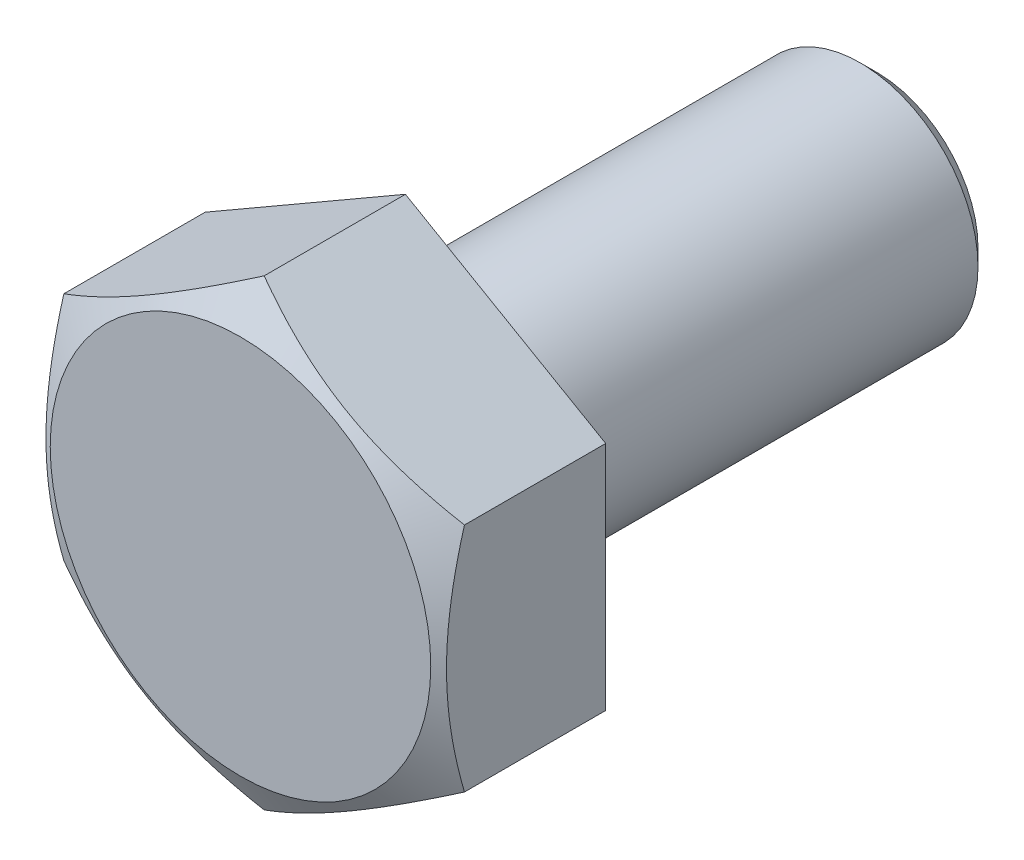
ISO-10303-21;
HEADER;
FILE_DESCRIPTION(('STEP AP214'),'2;1');
FILE_NAME('part.step','',(''),(''),'','','');
FILE_SCHEMA(('AUTOMOTIVE_DESIGN { 1 0 10303 214 1 1 1 1 }'));
ENDSEC;
DATA;
#1=APPLICATION_CONTEXT('core data for automotive mechanical design processes');
#2=APPLICATION_PROTOCOL_DEFINITION('international standard','automotive_design',2000,#1);
#3=PRODUCT_CONTEXT('',#1,'mechanical');
#4=PRODUCT('Part','Part','',(#3));
#5=PRODUCT_RELATED_PRODUCT_CATEGORY('part','',(#4));
#6=PRODUCT_DEFINITION_FORMATION('','',#4);
#7=PRODUCT_DEFINITION_CONTEXT('part definition',#1,'design');
#8=PRODUCT_DEFINITION('design','',#6,#7);
#9=PRODUCT_DEFINITION_SHAPE('','',#8);
#10=(LENGTH_UNIT() NAMED_UNIT(*) SI_UNIT(.MILLI.,.METRE.));
#11=(NAMED_UNIT(*) PLANE_ANGLE_UNIT() SI_UNIT($,.RADIAN.));
#12=(NAMED_UNIT(*) SI_UNIT($,.STERADIAN.) SOLID_ANGLE_UNIT());
#13=UNCERTAINTY_MEASURE_WITH_UNIT(LENGTH_MEASURE(1.E-05),#10,'distance_accuracy_value','');
#14=(GEOMETRIC_REPRESENTATION_CONTEXT(3) GLOBAL_UNCERTAINTY_ASSIGNED_CONTEXT((#13)) GLOBAL_UNIT_ASSIGNED_CONTEXT((#10,
#11,#12)) REPRESENTATION_CONTEXT('',''));
#15=CARTESIAN_POINT('',(0.,0.,0.));
#16=DIRECTION('',(0.,0.,1.));
#17=DIRECTION('',(1.,0.,0.));
#18=AXIS2_PLACEMENT_3D('',#15,#16,#17);
#19=CARTESIAN_POINT('',(8.50000000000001,-4.90747728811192,-0.001000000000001));
#20=DIRECTION('',(-0.499999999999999,0.866025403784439,0.));
#21=DIRECTION('',(-0.866025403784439,-0.499999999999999,0.));
#22=AXIS2_PLACEMENT_3D('',#19,#20,#21);
#23=PLANE('',#22);
#24=CARTESIAN_POINT('',(-0.000200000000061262,-9.81507004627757,5.99537008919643));
#25=CARTESIAN_POINT('',(0.18663922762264,-9.70719836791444,6.05763999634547));
#26=CARTESIAN_POINT('',(0.374175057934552,-9.59892450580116,6.11708383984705));
#27=CARTESIAN_POINT('',(0.750769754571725,-9.38149745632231,6.22954102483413));
#28=CARTESIAN_POINT('',(0.93982924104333,-9.27234391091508,6.28255159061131));
#29=CARTESIAN_POINT('',(1.51003475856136,-8.94313560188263,6.43089274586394));
#30=CARTESIAN_POINT('',(1.89343164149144,-8.72178130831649,6.51526720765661));
#31=CARTESIAN_POINT('',(2.46717766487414,-8.39052888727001,6.61420611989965));
#32=CARTESIAN_POINT('',(2.65581276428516,-8.28162036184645,6.64239093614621));
#33=CARTESIAN_POINT('',(3.03393602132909,-8.06331079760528,6.68965205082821));
#34=CARTESIAN_POINT('',(3.22342410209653,-7.95390980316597,6.70872915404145));
#35=CARTESIAN_POINT('',(3.60272652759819,-7.73491944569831,6.73729136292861));
#36=CARTESIAN_POINT('',(3.79254025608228,-7.62533043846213,6.74678735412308));
#37=CARTESIAN_POINT('',(4.17234305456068,-7.40605119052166,6.75598375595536));
#38=CARTESIAN_POINT('',(4.36233211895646,-7.29636095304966,6.75568446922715));
#39=CARTESIAN_POINT('',(4.71752301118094,-7.09129139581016,6.74597166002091));
#40=CARTESIAN_POINT('',(4.8827499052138,-6.99589760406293,6.73774296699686));
#41=CARTESIAN_POINT('',(5.21281671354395,-6.80533344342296,6.71403689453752));
#42=CARTESIAN_POINT('',(5.37765660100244,-6.71016309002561,6.69855902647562));
#43=CARTESIAN_POINT('',(5.87153810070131,-6.42502047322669,6.64161751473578));
#44=CARTESIAN_POINT('',(6.19970550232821,-6.23555293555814,6.58965307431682));
#45=CARTESIAN_POINT('',(6.85952142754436,-5.854608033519,6.45974119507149));
#46=CARTESIAN_POINT('',(7.19108574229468,-5.66317928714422,6.3812430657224));
#47=CARTESIAN_POINT('',(7.84926989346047,-5.28317649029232,6.20308479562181));
#48=CARTESIAN_POINT('',(8.17589815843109,-5.0945975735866,6.10346649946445));
#49=CARTESIAN_POINT('',(8.50020000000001,-4.90736181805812,5.99537008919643));
#50=B_SPLINE_CURVE_WITH_KNOTS('',3,(#24,#25,#26,#27,#28,#29,#30,#31,#32,#33,#34,#35,#36,#37,#38,
#39,#40,#41,#42,#43,#44,#45,#46,#47,#48,#49),.UNSPECIFIED.,.F.,.F.,(4,2,2,2,2,2,2,2,2,2,2,2,4),
(0.,0.673596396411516,1.34748239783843,2.69805431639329,3.35679995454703,4.01548737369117,
4.6734255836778,5.33134346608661,5.90409556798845,6.47688628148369,7.6232836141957,
8.79510569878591,9.96462743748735),.UNSPECIFIED.);
#51=CARTESIAN_POINT('',(0.,-9.81495457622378,5.99543675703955));
#52=VERTEX_POINT('',#51);
#53=CARTESIAN_POINT('',(8.50000000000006,-4.90747728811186,5.99543675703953));
#54=VERTEX_POINT('',#53);
#55=EDGE_CURVE('E49',#52,#54,#50,.T.);
#56=ORIENTED_EDGE('',*,*,#55,.F.);
#57=DIRECTION('',(0.,0.,1.));
#58=VECTOR('',#57,1.);
#59=CARTESIAN_POINT('',(0.,-9.81495457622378,-0.00100000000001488));
#60=LINE('',#59,#58);
#61=CARTESIAN_POINT('',(0.,-9.81495457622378,0.));
#62=VERTEX_POINT('',#61);
#63=EDGE_CURVE('E120',#62,#52,#60,.T.);
#64=ORIENTED_EDGE('',*,*,#63,.F.);
#65=DIRECTION('',(0.866025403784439,0.499999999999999,0.));
#66=VECTOR('',#65,1.);
#67=CARTESIAN_POINT('',(8.50000000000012,-4.90747728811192,0.));
#68=LINE('',#67,#66);
#69=CARTESIAN_POINT('',(8.50000000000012,-4.90747728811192,0.));
#70=VERTEX_POINT('',#69);
#71=EDGE_CURVE('E57',#62,#70,#68,.T.);
#72=ORIENTED_EDGE('',*,*,#71,.T.);
#73=DIRECTION('',(0.,0.,1.));
#74=VECTOR('',#73,1.);
#75=CARTESIAN_POINT('',(8.50000000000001,-4.90747728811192,-0.001000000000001));
#76=LINE('',#75,#74);
#77=EDGE_CURVE('E108',#70,#54,#76,.T.);
#78=ORIENTED_EDGE('',*,*,#77,.T.);
#79=EDGE_LOOP('',(#56,#64,#72,#78));
#80=FACE_BOUND('',#79,.T.);
#81=ADVANCED_FACE('F34',(#80),#23,.F.);
#82=CARTESIAN_POINT('',(-8.49999999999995,-4.90747728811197,-0.001000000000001));
#83=DIRECTION('',(-0.499999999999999,-0.866025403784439,0.));
#84=DIRECTION('',(0.866025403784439,-0.499999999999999,0.));
#85=AXIS2_PLACEMENT_3D('',#82,#83,#84);
#86=PLANE('',#85);
#87=ORIENTED_EDGE('',*,*,#63,.T.);
#88=CARTESIAN_POINT('',(0.00019999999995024,-9.81507004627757,5.99537008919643));
#89=CARTESIAN_POINT('',(-0.186639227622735,-9.70719836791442,6.05763999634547));
#90=CARTESIAN_POINT('',(-0.374175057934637,-9.59892450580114,6.11708383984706));
#91=CARTESIAN_POINT('',(-0.750769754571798,-9.38149745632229,6.22954102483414));
#92=CARTESIAN_POINT('',(-0.9398292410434,-9.27234391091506,6.28255159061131));
#93=CARTESIAN_POINT('',(-1.51003475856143,-8.94313560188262,6.43089274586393));
#94=CARTESIAN_POINT('',(-1.89343164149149,-8.72178130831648,6.5152672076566));
#95=CARTESIAN_POINT('',(-2.46717766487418,-8.39052888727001,6.61420611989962));
#96=CARTESIAN_POINT('',(-2.65581276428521,-8.28162036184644,6.64239093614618));
#97=CARTESIAN_POINT('',(-3.03393602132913,-8.06331079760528,6.68965205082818));
#98=CARTESIAN_POINT('',(-3.22342410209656,-7.95390980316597,6.70872915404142));
#99=CARTESIAN_POINT('',(-3.60272652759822,-7.73491944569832,6.73729136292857));
#100=CARTESIAN_POINT('',(-3.79254025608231,-7.62533043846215,6.74678735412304));
#101=CARTESIAN_POINT('',(-4.17234305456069,-7.40605119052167,6.75598375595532));
#102=CARTESIAN_POINT('',(-4.36233211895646,-7.29636095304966,6.75568446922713));
#103=CARTESIAN_POINT('',(-4.71752301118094,-7.09129139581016,6.74597166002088));
#104=CARTESIAN_POINT('',(-4.8827499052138,-6.99589760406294,6.73774296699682));
#105=CARTESIAN_POINT('',(-5.21281671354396,-6.80533344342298,6.71403689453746));
#106=CARTESIAN_POINT('',(-5.37765660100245,-6.71016309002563,6.69855902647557));
#107=CARTESIAN_POINT('',(-5.87153810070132,-6.4250204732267,6.64161751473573));
#108=CARTESIAN_POINT('',(-6.19970550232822,-6.23555293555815,6.58965307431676));
#109=CARTESIAN_POINT('',(-6.85952142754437,-5.85460803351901,6.45974119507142));
#110=CARTESIAN_POINT('',(-7.19108574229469,-5.66317928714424,6.38124306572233));
#111=CARTESIAN_POINT('',(-7.84926989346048,-5.28317649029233,6.20308479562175));
#112=CARTESIAN_POINT('',(-8.17589815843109,-5.09459757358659,6.10346649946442));
#113=CARTESIAN_POINT('',(-8.50020000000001,-4.90736181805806,5.99537008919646));
#114=B_SPLINE_CURVE_WITH_KNOTS('',3,(#88,#89,#90,#91,#92,#93,#94,#95,#96,#97,#98,#99,#100,#101,
#102,#103,#104,#105,#106,#107,#108,#109,#110,#111,#112,#113),.UNSPECIFIED.,.F.,.F.,(4,2,2,2,2,2,
2,2,2,2,2,2,4),(0.,0.6735963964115,1.3474823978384,2.69805431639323,3.35679995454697,
4.0154873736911,4.67342558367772,5.33134346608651,5.90409556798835,6.47688628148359,
7.6232836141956,8.79510569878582,9.96462743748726),.UNSPECIFIED.);
#115=CARTESIAN_POINT('',(-8.4999999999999,-4.90747728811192,5.99543675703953));
#116=VERTEX_POINT('',#115);
#117=EDGE_CURVE('E162',#52,#116,#114,.T.);
#118=ORIENTED_EDGE('',*,*,#117,.T.);
#119=DIRECTION('',(0.,0.,1.));
#120=VECTOR('',#119,1.);
#121=CARTESIAN_POINT('',(-8.49999999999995,-4.90747728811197,-0.001000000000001));
#122=LINE('',#121,#120);
#123=CARTESIAN_POINT('',(-8.50000000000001,-4.90747728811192,0.));
#124=VERTEX_POINT('',#123);
#125=EDGE_CURVE('E117',#124,#116,#122,.T.);
#126=ORIENTED_EDGE('',*,*,#125,.F.);
#127=DIRECTION('',(-0.866025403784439,0.499999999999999,0.));
#128=VECTOR('',#127,1.);
#129=CARTESIAN_POINT('',(-8.50000000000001,-4.90747728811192,0.));
#130=LINE('',#129,#128);
#131=EDGE_CURVE('E224',#62,#124,#130,.T.);
#132=ORIENTED_EDGE('',*,*,#131,.F.);
#133=EDGE_LOOP('',(#87,#118,#126,#132));
#134=FACE_BOUND('',#133,.T.);
#135=ADVANCED_FACE('F139',(#134),#86,.T.);
#136=CARTESIAN_POINT('',(-8.49999999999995,-4.90747728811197,-0.001000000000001));
#137=DIRECTION('',(0.999999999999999,0.,0.));
#138=DIRECTION('',(0.,0.,-1.));
#139=AXIS2_PLACEMENT_3D('',#136,#137,#138);
#140=PLANE('',#139);
#141=CARTESIAN_POINT('',(-8.49999999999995,-13.3300385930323,2.53449094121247));
#142=CARTESIAN_POINT('',(-8.49999999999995,-12.9574590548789,2.71581539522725));
#143=CARTESIAN_POINT('',(-8.49999999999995,-12.5840398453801,2.89544329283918));
#144=CARTESIAN_POINT('',(-8.49999999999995,-11.8350759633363,3.25035446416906));
#145=CARTESIAN_POINT('',(-8.49999999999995,-11.4595309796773,3.42563708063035));
#146=CARTESIAN_POINT('',(-8.49999999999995,-10.7040053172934,3.77175626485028));
#147=CARTESIAN_POINT('',(-8.49999999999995,-10.3240117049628,3.94256469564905));
#148=CARTESIAN_POINT('',(-8.49999999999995,-9.5610528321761,4.27738456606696));
#149=CARTESIAN_POINT('',(-8.49999999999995,-9.17808770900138,4.44139631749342));
#150=CARTESIAN_POINT('',(-8.49999999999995,-8.39578771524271,4.76614171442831));
#151=CARTESIAN_POINT('',(-8.49999999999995,-7.99633177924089,4.92658529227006));
#152=CARTESIAN_POINT('',(-8.49999999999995,-7.19280284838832,5.23568387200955));
#153=CARTESIAN_POINT('',(-8.49999999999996,-6.78872934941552,5.38433757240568));
#154=CARTESIAN_POINT('',(-8.49999999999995,-5.97602651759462,5.66606258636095));
#155=CARTESIAN_POINT('',(-8.49999999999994,-5.56740779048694,5.7991641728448));
#156=CARTESIAN_POINT('',(-8.49999999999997,-4.74432557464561,6.0456140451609));
#157=CARTESIAN_POINT('',(-8.50000000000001,-4.32986392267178,6.15896839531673));
#158=CARTESIAN_POINT('',(-8.50000000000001,-3.49705590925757,6.3599825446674));
#159=CARTESIAN_POINT('',(-8.49999999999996,-3.07874445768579,6.44778313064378));
#160=CARTESIAN_POINT('',(-8.49999999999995,-2.44735308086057,6.55657967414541));
#161=CARTESIAN_POINT('',(-8.49999999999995,-2.23622125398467,6.58902917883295));
#162=CARTESIAN_POINT('',(-8.49999999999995,-1.81285861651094,6.64566086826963));
#163=CARTESIAN_POINT('',(-8.49999999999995,-1.60062791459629,6.66984385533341));
#164=CARTESIAN_POINT('',(-8.49999999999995,-1.17819018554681,6.7091493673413));
#165=CARTESIAN_POINT('',(-8.49999999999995,-0.967994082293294,6.72438880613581));
#166=CARTESIAN_POINT('',(-8.49999999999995,-0.54714528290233,6.74595843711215));
#167=CARTESIAN_POINT('',(-8.49999999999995,-0.336492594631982,6.75228878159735));
#168=CARTESIAN_POINT('',(-8.49999999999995,0.0848938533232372,6.75588862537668));
#169=CARTESIAN_POINT('',(-8.49999999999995,0.295627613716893,6.75315804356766));
#170=CARTESIAN_POINT('',(-8.49999999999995,0.716788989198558,6.73870443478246));
#171=CARTESIAN_POINT('',(-8.49999999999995,0.927216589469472,6.7269809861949));
#172=CARTESIAN_POINT('',(-8.49999999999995,1.42840873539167,6.68860038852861));
#173=CARTESIAN_POINT('',(-8.49999999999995,1.71887274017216,6.65792861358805));
#174=CARTESIAN_POINT('',(-8.49999999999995,2.29772833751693,6.58108968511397));
#175=CARTESIAN_POINT('',(-8.49999999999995,2.58611966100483,6.53492055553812));
#176=CARTESIAN_POINT('',(-8.49999999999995,3.44779761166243,6.37560864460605));
#177=CARTESIAN_POINT('',(-8.49999999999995,4.01729795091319,6.24168658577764));
#178=CARTESIAN_POINT('',(-8.49999999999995,4.86928176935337,6.00833364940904));
#179=CARTESIAN_POINT('',(-8.49999999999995,5.15615049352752,5.92398381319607));
#180=CARTESIAN_POINT('',(-8.49999999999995,5.72710339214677,5.74625067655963));
#181=CARTESIAN_POINT('',(-8.49999999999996,6.01118754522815,5.65286730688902));
#182=CARTESIAN_POINT('',(-8.49999999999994,6.57665930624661,5.45858816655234));
#183=CARTESIAN_POINT('',(-8.49999999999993,6.85804767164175,5.35769458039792));
#184=CARTESIAN_POINT('',(-8.49999999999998,7.41847111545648,5.14960951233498));
#185=CARTESIAN_POINT('',(-8.50000000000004,7.69750624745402,5.04241817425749));
#186=CARTESIAN_POINT('',(-8.5000000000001,8.44980890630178,4.74523309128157));
#187=CARTESIAN_POINT('',(-8.49999999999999,8.92109165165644,4.55021974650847));
#188=CARTESIAN_POINT('',(-8.49999999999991,9.85881492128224,4.14883877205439));
#189=CARTESIAN_POINT('',(-8.49999999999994,10.3252549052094,3.94246989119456));
#190=CARTESIAN_POINT('',(-8.49999999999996,11.2544088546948,3.52107400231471));
#191=CARTESIAN_POINT('',(-8.49999999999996,11.7171213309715,3.30604372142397));
#192=CARTESIAN_POINT('',(-8.49999999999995,12.639397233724,2.86940227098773));
#193=CARTESIAN_POINT('',(-8.49999999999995,13.098960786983,2.64779136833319));
#194=CARTESIAN_POINT('',(-8.49999999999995,14.0162966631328,2.19906730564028));
#195=CARTESIAN_POINT('',(-8.49999999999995,14.4740649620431,1.97194593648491));
#196=CARTESIAN_POINT('',(-8.49999999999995,15.3875498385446,1.51361143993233));
#197=CARTESIAN_POINT('',(-8.49999999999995,15.84326639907,1.28239827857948));
#198=CARTESIAN_POINT('',(-8.49999999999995,16.7529150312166,0.816736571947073));
#199=CARTESIAN_POINT('',(-8.49999999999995,17.2068474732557,0.582288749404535));
#200=CARTESIAN_POINT('',(-8.49999999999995,18.1133194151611,0.110714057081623));
#201=CARTESIAN_POINT('',(-8.49999999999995,18.5658589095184,-0.12641282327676));
#202=CARTESIAN_POINT('',(-8.49999999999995,19.8259423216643,-0.790591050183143));
#203=CARTESIAN_POINT('',(-8.49999999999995,20.6322150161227,-1.22005367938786));
#204=CARTESIAN_POINT('',(-8.49999999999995,22.2420810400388,-2.08407815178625));
#205=CARTESIAN_POINT('',(-8.49999999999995,23.0456742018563,-2.51864030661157));
#206=CARTESIAN_POINT('',(-8.49999999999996,24.6481263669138,-3.39011718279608));
#207=CARTESIAN_POINT('',(-8.49999999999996,25.4469922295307,-3.82701929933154));
#208=CARTESIAN_POINT('',(-8.49999999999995,26.6440649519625,-4.4845286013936));
#209=CARTESIAN_POINT('',(-8.49999999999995,27.042869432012,-4.70404918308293));
#210=CARTESIAN_POINT('',(-8.49999999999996,27.8401226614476,-5.143734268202));
#211=CARTESIAN_POINT('',(-8.49999999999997,28.238571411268,-5.36389877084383));
#212=CARTESIAN_POINT('',(-8.50000000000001,28.6368640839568,-5.58434533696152));
#213=B_SPLINE_CURVE_WITH_KNOTS('',3,(#141,#142,#143,#144,#145,#146,#147,#148,#149,#150,#151,
#152,#153,#154,#155,#156,#157,#158,#159,#160,#161,#162,#163,#164,#165,#166,#167,#168,#169,#170,
#171,#172,#173,#174,#175,#176,#177,#178,#179,#180,#181,#182,#183,#184,#185,#186,#187,#188,#189,
#190,#191,#192,#193,#194,#195,#196,#197,#198,#199,#200,#201,#202,#203,#204,#205,#206,#207,#208,
#209,#210,#211,#212),.UNSPECIFIED.,.F.,.F.,(4,2,2,2,2,2,2,2,2,2,2,2,2,2,2,2,2,2,2,2,2,2,2,2,2,2,
2,2,2,2,2,2,2,2,2,4),(0.,1.2430939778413,2.48637484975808,3.73617582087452,4.98591939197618,
6.27719450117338,7.56861195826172,8.85747218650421,10.1459359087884,11.4271603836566,
12.0678568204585,12.7084910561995,13.3405525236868,13.9726031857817,14.6046595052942,
15.2367454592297,16.1124907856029,16.9883478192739,18.7409320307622,19.6378908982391,
20.5348566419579,21.4315624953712,22.3282478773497,23.8581353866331,25.3881918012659,
26.9188319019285,28.4494100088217,29.9824283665,31.5154594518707,33.0481533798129,
34.5808533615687,37.3213766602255,40.0620683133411,42.7936585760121,44.1593479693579,
45.5250356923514),.UNSPECIFIED.);
#214=CARTESIAN_POINT('',(-8.49999999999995,4.90747728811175,5.99543675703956));
#215=VERTEX_POINT('',#214);
#216=EDGE_CURVE('E197',#215,#116,#213,.F.);
#217=ORIENTED_EDGE('',*,*,#216,.F.);
#218=DIRECTION('',(0.,0.,1.));
#219=VECTOR('',#218,1.);
#220=CARTESIAN_POINT('',(-8.50000000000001,4.90747728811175,-0.00100000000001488));
#221=LINE('',#220,#219);
#222=CARTESIAN_POINT('',(-8.50000000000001,4.90747728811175,0.));
#223=VERTEX_POINT('',#222);
#224=EDGE_CURVE('E110',#223,#215,#221,.T.);
#225=ORIENTED_EDGE('',*,*,#224,.F.);
#226=DIRECTION('',(0.,-1.,0.));
#227=VECTOR('',#226,1.);
#228=CARTESIAN_POINT('',(-8.50000000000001,-4.90747728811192,0.));
#229=LINE('',#228,#227);
#230=EDGE_CURVE('E225',#223,#124,#229,.T.);
#231=ORIENTED_EDGE('',*,*,#230,.T.);
#232=ORIENTED_EDGE('',*,*,#125,.T.);
#233=EDGE_LOOP('',(#217,#225,#231,#232));
#234=FACE_BOUND('',#233,.T.);
#235=ADVANCED_FACE('F145',(#234),#140,.F.);
#236=CARTESIAN_POINT('',(-8.50000000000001,4.90747728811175,-0.00100000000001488));
#237=DIRECTION('',(0.499999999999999,-0.866025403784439,0.));
#238=DIRECTION('',(0.866025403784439,0.499999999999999,0.));
#239=AXIS2_PLACEMENT_3D('',#236,#237,#238);
#240=PLANE('',#239);
#241=CARTESIAN_POINT('',(0.000200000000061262,9.81507004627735,5.99537008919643));
#242=CARTESIAN_POINT('',(-0.186639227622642,9.70719836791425,6.05763999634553));
#243=CARTESIAN_POINT('',(-0.374175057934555,9.59892450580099,6.11708383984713));
#244=CARTESIAN_POINT('',(-0.75076975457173,9.38149745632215,6.22954102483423));
#245=CARTESIAN_POINT('',(-0.939829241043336,9.27234391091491,6.2825515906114));
#246=CARTESIAN_POINT('',(-1.51003475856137,8.94313560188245,6.43089274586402));
#247=CARTESIAN_POINT('',(-1.89343164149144,8.72178130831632,6.51526720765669));
#248=CARTESIAN_POINT('',(-2.46717766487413,8.39052888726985,6.61420611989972));
#249=CARTESIAN_POINT('',(-2.65581276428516,8.28162036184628,6.64239093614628));
#250=CARTESIAN_POINT('',(-3.03393602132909,8.06331079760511,6.68965205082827));
#251=CARTESIAN_POINT('',(-3.22342410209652,7.95390980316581,6.70872915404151));
#252=CARTESIAN_POINT('',(-3.60272652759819,7.73491944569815,6.73729136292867));
#253=CARTESIAN_POINT('',(-3.79254025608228,7.62533043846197,6.74678735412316));
#254=CARTESIAN_POINT('',(-4.17234305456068,7.40605119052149,6.75598375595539));
#255=CARTESIAN_POINT('',(-4.36233211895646,7.29636095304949,6.75568446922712));
#256=CARTESIAN_POINT('',(-4.71752301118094,7.09129139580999,6.74597166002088));
#257=CARTESIAN_POINT('',(-4.88274990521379,6.99589760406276,6.73774296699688));
#258=CARTESIAN_POINT('',(-5.21281671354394,6.80533344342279,6.71403689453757));
#259=CARTESIAN_POINT('',(-5.37765660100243,6.71016309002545,6.69855902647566));
#260=CARTESIAN_POINT('',(-5.87153810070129,6.42502047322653,6.6416175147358));
#261=CARTESIAN_POINT('',(-6.19970550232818,6.23555293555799,6.58965307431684));
#262=CARTESIAN_POINT('',(-6.85952142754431,5.85460803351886,6.45974119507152));
#263=CARTESIAN_POINT('',(-7.19108574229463,5.66317928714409,6.38124306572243));
#264=CARTESIAN_POINT('',(-7.84926989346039,5.28317649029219,6.20308479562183));
#265=CARTESIAN_POINT('',(-8.175898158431,5.09459757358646,6.10346649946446));
#266=CARTESIAN_POINT('',(-8.5001999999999,4.90736181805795,5.99537008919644));
#267=B_SPLINE_CURVE_WITH_KNOTS('',3,(#241,#242,#243,#244,#245,#246,#247,#248,#249,#250,#251,
#252,#253,#254,#255,#256,#257,#258,#259,#260,#261,#262,#263,#264,#265,#266),.UNSPECIFIED.,.F.,
.F.,(4,2,2,2,2,2,2,2,2,2,2,2,4),(0.,0.673596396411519,1.34748239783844,2.69805431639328,
3.35679995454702,4.01548737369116,4.67342558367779,5.3313434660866,5.90409556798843,
6.47688628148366,7.62328361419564,8.79510569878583,9.96462743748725),.UNSPECIFIED.);
#268=CARTESIAN_POINT('',(0.,9.81495457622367,5.99543675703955));
#269=VERTEX_POINT('',#268);
#270=EDGE_CURVE('E103',#269,#215,#267,.T.);
#271=ORIENTED_EDGE('',*,*,#270,.F.);
#272=DIRECTION('',(0.,0.,1.));
#273=VECTOR('',#272,1.);
#274=CARTESIAN_POINT('',(0.,9.81495457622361,-0.000999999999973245));
#275=LINE('',#274,#273);
#276=CARTESIAN_POINT('',(0.,9.81495457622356,0.));
#277=VERTEX_POINT('',#276);
#278=EDGE_CURVE('E102',#277,#269,#275,.T.);
#279=ORIENTED_EDGE('',*,*,#278,.F.);
#280=DIRECTION('',(-0.866025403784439,-0.499999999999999,0.));
#281=VECTOR('',#280,1.);
#282=CARTESIAN_POINT('',(-8.50000000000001,4.90747728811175,0.));
#283=LINE('',#282,#281);
#284=EDGE_CURVE('E229',#277,#223,#283,.T.);
#285=ORIENTED_EDGE('',*,*,#284,.T.);
#286=ORIENTED_EDGE('',*,*,#224,.T.);
#287=EDGE_LOOP('',(#271,#279,#285,#286));
#288=FACE_BOUND('',#287,.T.);
#289=ADVANCED_FACE('F204',(#288),#240,.F.);
#290=CARTESIAN_POINT('',(8.50000000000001,4.90747728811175,-0.00100000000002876));
#291=DIRECTION('',(0.499999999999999,0.866025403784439,0.));
#292=DIRECTION('',(-0.866025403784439,0.499999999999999,0.));
#293=AXIS2_PLACEMENT_3D('',#290,#291,#292);
#294=PLANE('',#293);
#295=ORIENTED_EDGE('',*,*,#278,.T.);
#296=CARTESIAN_POINT('',(-0.000200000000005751,9.81507004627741,5.99537008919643));
#297=CARTESIAN_POINT('',(0.186639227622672,9.70719836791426,6.05763999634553));
#298=CARTESIAN_POINT('',(0.374175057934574,9.59892450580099,6.11708383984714));
#299=CARTESIAN_POINT('',(0.750769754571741,9.38149745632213,6.22954102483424));
#300=CARTESIAN_POINT('',(0.93982924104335,9.2723439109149,6.28255159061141));
#301=CARTESIAN_POINT('',(1.51003475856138,8.94313560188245,6.43089274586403));
#302=CARTESIAN_POINT('',(1.89343164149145,8.72178130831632,6.51526720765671));
#303=CARTESIAN_POINT('',(2.46717766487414,8.39052888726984,6.61420611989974));
#304=CARTESIAN_POINT('',(2.65581276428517,8.28162036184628,6.6423909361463));
#305=CARTESIAN_POINT('',(3.03393602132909,8.06331079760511,6.68965205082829));
#306=CARTESIAN_POINT('',(3.22342410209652,7.95390980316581,6.70872915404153));
#307=CARTESIAN_POINT('',(3.60272652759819,7.73491944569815,6.7372913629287));
#308=CARTESIAN_POINT('',(3.79254025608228,7.62533043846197,6.74678735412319));
#309=CARTESIAN_POINT('',(4.17234305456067,7.40605119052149,6.75598375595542));
#310=CARTESIAN_POINT('',(4.36233211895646,7.29636095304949,6.75568446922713));
#311=CARTESIAN_POINT('',(4.71752301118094,7.09129139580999,6.7459716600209));
#312=CARTESIAN_POINT('',(4.8827499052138,6.99589760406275,6.73774296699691));
#313=CARTESIAN_POINT('',(5.21281671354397,6.80533344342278,6.71403689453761));
#314=CARTESIAN_POINT('',(5.37765660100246,6.71016309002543,6.6985590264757));
#315=CARTESIAN_POINT('',(5.87153810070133,6.42502047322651,6.64161751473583));
#316=CARTESIAN_POINT('',(6.19970550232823,6.23555293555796,6.58965307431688));
#317=CARTESIAN_POINT('',(6.85952142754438,5.85460803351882,6.45974119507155));
#318=CARTESIAN_POINT('',(7.1910857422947,5.66317928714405,6.38124306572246));
#319=CARTESIAN_POINT('',(7.84926989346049,5.28317649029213,6.20308479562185));
#320=CARTESIAN_POINT('',(8.1758981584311,5.09459757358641,6.10346649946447));
#321=CARTESIAN_POINT('',(8.50020000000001,4.9073618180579,5.99537008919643));
#322=B_SPLINE_CURVE_WITH_KNOTS('',3,(#296,#297,#298,#299,#300,#301,#302,#303,#304,#305,#306,
#307,#308,#309,#310,#311,#312,#313,#314,#315,#316,#317,#318,#319,#320,#321),.UNSPECIFIED.,.F.,
.F.,(4,2,2,2,2,2,2,2,2,2,2,2,4),(0.,0.673596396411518,1.34748239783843,2.69805431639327,
3.35679995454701,4.01548737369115,4.67342558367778,5.33134346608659,5.90409556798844,
6.47688628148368,7.6232836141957,8.79510569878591,9.96462743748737),.UNSPECIFIED.);
#323=CARTESIAN_POINT('',(8.50000000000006,4.90747728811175,5.99543675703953));
#324=VERTEX_POINT('',#323);
#325=EDGE_CURVE('E87',#269,#324,#322,.T.);
#326=ORIENTED_EDGE('',*,*,#325,.T.);
#327=DIRECTION('',(0.,0.,1.));
#328=VECTOR('',#327,1.);
#329=CARTESIAN_POINT('',(8.50000000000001,4.90747728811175,-0.00100000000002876));
#330=LINE('',#329,#328);
#331=CARTESIAN_POINT('',(8.50000000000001,4.90747728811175,0.));
#332=VERTEX_POINT('',#331);
#333=EDGE_CURVE('E100',#332,#324,#330,.T.);
#334=ORIENTED_EDGE('',*,*,#333,.F.);
#335=DIRECTION('',(0.866025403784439,-0.499999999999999,0.));
#336=VECTOR('',#335,1.);
#337=CARTESIAN_POINT('',(8.50000000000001,4.90747728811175,0.));
#338=LINE('',#337,#336);
#339=EDGE_CURVE('E161',#277,#332,#338,.T.);
#340=ORIENTED_EDGE('',*,*,#339,.F.);
#341=EDGE_LOOP('',(#295,#326,#334,#340));
#342=FACE_BOUND('',#341,.T.);
#343=ADVANCED_FACE('F98',(#342),#294,.T.);
#344=CARTESIAN_POINT('',(8.50000000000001,-4.90747728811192,-0.001000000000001));
#345=DIRECTION('',(0.999999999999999,0.,0.));
#346=DIRECTION('',(0.,0.,-1.));
#347=AXIS2_PLACEMENT_3D('',#344,#345,#346);
#348=PLANE('',#347);
#349=ORIENTED_EDGE('',*,*,#333,.T.);
#350=CARTESIAN_POINT('',(8.4999999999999,-13.3300385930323,2.5344909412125));
#351=CARTESIAN_POINT('',(8.49999999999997,-12.957459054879,2.71581539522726));
#352=CARTESIAN_POINT('',(8.5,-12.5840398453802,2.89544329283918));
#353=CARTESIAN_POINT('',(8.50000000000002,-11.8350759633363,3.25035446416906));
#354=CARTESIAN_POINT('',(8.50000000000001,-11.4595309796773,3.42563708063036));
#355=CARTESIAN_POINT('',(8.5,-10.7040053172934,3.77175626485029));
#356=CARTESIAN_POINT('',(8.50000000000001,-10.3240117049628,3.94256469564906));
#357=CARTESIAN_POINT('',(8.50000000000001,-9.56105283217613,4.27738456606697));
#358=CARTESIAN_POINT('',(8.50000000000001,-9.17808770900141,4.44139631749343));
#359=CARTESIAN_POINT('',(8.50000000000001,-8.39578771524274,4.76614171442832));
#360=CARTESIAN_POINT('',(8.50000000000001,-7.99633177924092,4.92658529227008));
#361=CARTESIAN_POINT('',(8.50000000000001,-7.19280284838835,5.23568387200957));
#362=CARTESIAN_POINT('',(8.5,-6.78872934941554,5.38433757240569));
#363=CARTESIAN_POINT('',(8.50000000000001,-5.97602651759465,5.66606258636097));
#364=CARTESIAN_POINT('',(8.50000000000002,-5.56740779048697,5.79916417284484));
#365=CARTESIAN_POINT('',(8.49999999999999,-4.74432557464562,6.04561404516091));
#366=CARTESIAN_POINT('',(8.49999999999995,-4.32986392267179,6.1589683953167));
#367=CARTESIAN_POINT('',(8.49999999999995,-3.49705590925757,6.35998254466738));
#368=CARTESIAN_POINT('',(8.5,-3.07874445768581,6.44778313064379));
#369=CARTESIAN_POINT('',(8.50000000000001,-2.44735308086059,6.55657967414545));
#370=CARTESIAN_POINT('',(8.50000000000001,-2.23622125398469,6.58902917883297));
#371=CARTESIAN_POINT('',(8.50000000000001,-1.81285861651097,6.64566086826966));
#372=CARTESIAN_POINT('',(8.50000000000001,-1.60062791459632,6.66984385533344));
#373=CARTESIAN_POINT('',(8.50000000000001,-1.17819018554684,6.70914936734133));
#374=CARTESIAN_POINT('',(8.50000000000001,-0.96799408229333,6.72438880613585));
#375=CARTESIAN_POINT('',(8.50000000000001,-0.547145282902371,6.74595843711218));
#376=CARTESIAN_POINT('',(8.5,-0.336492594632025,6.75228878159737));
#377=CARTESIAN_POINT('',(8.50000000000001,0.08489385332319,6.75588862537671));
#378=CARTESIAN_POINT('',(8.50000000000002,0.295627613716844,6.7531580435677));
#379=CARTESIAN_POINT('',(8.49999999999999,0.716788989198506,6.73870443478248));
#380=CARTESIAN_POINT('',(8.49999999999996,0.927216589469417,6.7269809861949));
#381=CARTESIAN_POINT('',(8.49999999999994,1.42840873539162,6.6886003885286));
#382=CARTESIAN_POINT('',(8.49999999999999,1.71887274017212,6.65792861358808));
#383=CARTESIAN_POINT('',(8.50000000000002,2.29772833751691,6.58108968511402));
#384=CARTESIAN_POINT('',(8.50000000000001,2.58611966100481,6.53492055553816));
#385=CARTESIAN_POINT('',(8.49999999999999,3.44779761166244,6.37560864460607));
#386=CARTESIAN_POINT('',(8.50000000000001,4.0172979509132,6.24168658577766));
#387=CARTESIAN_POINT('',(8.50000000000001,4.8692817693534,6.00833364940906));
#388=CARTESIAN_POINT('',(8.50000000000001,5.15615049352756,5.92398381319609));
#389=CARTESIAN_POINT('',(8.50000000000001,5.72710339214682,5.74625067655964));
#390=CARTESIAN_POINT('',(8.50000000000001,6.01118754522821,5.65286730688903));
#391=CARTESIAN_POINT('',(8.50000000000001,6.57665930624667,5.45858816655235));
#392=CARTESIAN_POINT('',(8.50000000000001,6.85804767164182,5.35769458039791));
#393=CARTESIAN_POINT('',(8.50000000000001,7.41847111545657,5.14960951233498));
#394=CARTESIAN_POINT('',(8.50000000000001,7.69750624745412,5.04241817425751));
#395=CARTESIAN_POINT('',(8.50000000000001,8.44980890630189,4.74523309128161));
#396=CARTESIAN_POINT('',(8.50000000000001,8.92109165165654,4.55021974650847));
#397=CARTESIAN_POINT('',(8.50000000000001,9.85881492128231,4.14883877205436));
#398=CARTESIAN_POINT('',(8.50000000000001,10.3252549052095,3.94246989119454));
#399=CARTESIAN_POINT('',(8.50000000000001,11.2544088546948,3.5210740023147));
#400=CARTESIAN_POINT('',(8.50000000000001,11.7171213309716,3.30604372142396));
#401=CARTESIAN_POINT('',(8.50000000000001,12.639397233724,2.86940227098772));
#402=CARTESIAN_POINT('',(8.50000000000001,13.098960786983,2.64779136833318));
#403=CARTESIAN_POINT('',(8.50000000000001,14.0162966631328,2.19906730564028));
#404=CARTESIAN_POINT('',(8.50000000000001,14.4740649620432,1.9719459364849));
#405=CARTESIAN_POINT('',(8.50000000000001,15.3875498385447,1.51361143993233));
#406=CARTESIAN_POINT('',(8.50000000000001,15.84326639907,1.28239827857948));
#407=CARTESIAN_POINT('',(8.50000000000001,16.7529150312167,0.816736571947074));
#408=CARTESIAN_POINT('',(8.50000000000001,17.2068474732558,0.582288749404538));
#409=CARTESIAN_POINT('',(8.50000000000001,18.1133194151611,0.110714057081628));
#410=CARTESIAN_POINT('',(8.50000000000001,18.5658589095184,-0.126412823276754));
#411=CARTESIAN_POINT('',(8.50000000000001,19.8259423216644,-0.790591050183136));
#412=CARTESIAN_POINT('',(8.50000000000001,20.6322150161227,-1.22005367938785));
#413=CARTESIAN_POINT('',(8.50000000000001,22.2420810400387,-2.08407815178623));
#414=CARTESIAN_POINT('',(8.5,23.0456742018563,-2.51864030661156));
#415=CARTESIAN_POINT('',(8.50000000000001,24.6481263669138,-3.39011718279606));
#416=CARTESIAN_POINT('',(8.50000000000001,25.4469922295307,-3.82701929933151));
#417=CARTESIAN_POINT('',(8.5,26.6440649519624,-4.48452860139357));
#418=CARTESIAN_POINT('',(8.5,27.042869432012,-4.7040491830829));
#419=CARTESIAN_POINT('',(8.50000000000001,27.8401226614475,-5.14373426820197));
#420=CARTESIAN_POINT('',(8.50000000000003,28.238571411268,-5.3638987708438));
#421=CARTESIAN_POINT('',(8.50000000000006,28.6368640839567,-5.5843453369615));
#422=B_SPLINE_CURVE_WITH_KNOTS('',3,(#350,#351,#352,#353,#354,#355,#356,#357,#358,#359,#360,
#361,#362,#363,#364,#365,#366,#367,#368,#369,#370,#371,#372,#373,#374,#375,#376,#377,#378,#379,
#380,#381,#382,#383,#384,#385,#386,#387,#388,#389,#390,#391,#392,#393,#394,#395,#396,#397,#398,
#399,#400,#401,#402,#403,#404,#405,#406,#407,#408,#409,#410,#411,#412,#413,#414,#415,#416,#417,
#418,#419,#420,#421),.UNSPECIFIED.,.F.,.F.,(4,2,2,2,2,2,2,2,2,2,2,2,2,2,2,2,2,2,2,2,2,2,2,2,2,2,
2,2,2,2,2,2,2,2,2,4),(0.,1.24309397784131,2.48637484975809,3.73617582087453,4.9859193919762,
6.2771945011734,7.56861195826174,8.85747218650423,10.1459359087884,11.4271603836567,
12.0678568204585,12.7084910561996,13.3405525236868,13.9726031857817,14.6046595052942,
15.2367454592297,16.1124907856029,16.988347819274,18.7409320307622,19.6378908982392,
20.534856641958,21.4315624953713,22.3282478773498,23.8581353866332,25.388191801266,
26.9188319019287,28.4494100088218,29.9824283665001,31.5154594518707,33.048153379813,
34.5808533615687,37.3213766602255,40.0620683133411,42.7936585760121,44.1593479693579,
45.5250356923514),.UNSPECIFIED.);
#423=EDGE_CURVE('E84',#324,#54,#422,.F.);
#424=ORIENTED_EDGE('',*,*,#423,.T.);
#425=ORIENTED_EDGE('',*,*,#77,.F.);
#426=DIRECTION('',(0.,-1.,0.));
#427=VECTOR('',#426,1.);
#428=CARTESIAN_POINT('',(8.50000000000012,-4.90747728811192,0.));
#429=LINE('',#428,#427);
#430=EDGE_CURVE('E107',#332,#70,#429,.T.);
#431=ORIENTED_EDGE('',*,*,#430,.F.);
#432=EDGE_LOOP('',(#349,#424,#425,#431));
#433=FACE_BOUND('',#432,.T.);
#434=ADVANCED_FACE('F106',(#433),#348,.T.);
#435=CARTESIAN_POINT('',(0.,0.,0.));
#436=DIRECTION('',(0.,0.,1.));
#437=DIRECTION('',(0.999999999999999,0.,0.));
#438=AXIS2_PLACEMENT_3D('',#435,#436,#437);
#439=PLANE('',#438);
#440=CARTESIAN_POINT('',(0.,0.,0.));
#441=DIRECTION('',(0.,0.,1.));
#442=DIRECTION('',(0.999999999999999,0.,0.));
#443=AXIS2_PLACEMENT_3D('',#440,#441,#442);
#444=CIRCLE('',#443,5.);
#445=CARTESIAN_POINT('',(5.,0.,0.));
#446=VERTEX_POINT('',#445);
#447=EDGE_CURVE('E222',#446,#446,#444,.T.);
#448=ORIENTED_EDGE('',*,*,#447,.T.);
#449=EDGE_LOOP('',(#448));
#450=FACE_BOUND('',#449,.T.);
#451=ORIENTED_EDGE('',*,*,#430,.T.);
#452=ORIENTED_EDGE('',*,*,#71,.F.);
#453=ORIENTED_EDGE('',*,*,#131,.T.);
#454=ORIENTED_EDGE('',*,*,#230,.F.);
#455=ORIENTED_EDGE('',*,*,#284,.F.);
#456=ORIENTED_EDGE('',*,*,#339,.T.);
#457=EDGE_LOOP('',(#451,#452,#453,#454,#455,#456));
#458=FACE_BOUND('',#457,.T.);
#459=ADVANCED_FACE('F173',(#450,#458),#439,.F.);
#460=CARTESIAN_POINT('',(0.,0.,7.00000000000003));
#461=DIRECTION('',(0.,0.,-1.));
#462=DIRECTION('',(0.999999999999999,0.,0.));
#463=AXIS2_PLACEMENT_3D('',#460,#461,#462);
#464=CONICAL_SURFACE('',#463,8.075,1.0471975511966);
#465=CARTESIAN_POINT('',(0.,0.,7.00000000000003));
#466=DIRECTION('',(0.,0.,1.));
#467=DIRECTION('',(0.999999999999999,0.,0.));
#468=AXIS2_PLACEMENT_3D('',#465,#466,#467);
#469=CIRCLE('',#468,8.075);
#470=CARTESIAN_POINT('',(8.07500000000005,0.,7.00000000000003));
#471=VERTEX_POINT('',#470);
#472=EDGE_CURVE('E93',#471,#471,#469,.T.);
#473=ORIENTED_EDGE('',*,*,#472,.F.);
#474=EDGE_LOOP('',(#473));
#475=FACE_BOUND('',#474,.T.);
#476=ORIENTED_EDGE('',*,*,#117,.F.);
#477=ORIENTED_EDGE('',*,*,#55,.T.);
#478=ORIENTED_EDGE('',*,*,#423,.F.);
#479=ORIENTED_EDGE('',*,*,#325,.F.);
#480=ORIENTED_EDGE('',*,*,#270,.T.);
#481=ORIENTED_EDGE('',*,*,#216,.T.);
#482=EDGE_LOOP('',(#476,#477,#478,#479,#480,#481));
#483=FACE_BOUND('',#482,.T.);
#484=ADVANCED_FACE('F86',(#475,#483),#464,.T.);
#485=CARTESIAN_POINT('',(0.,0.,7.00000000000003));
#486=DIRECTION('',(0.,0.,1.));
#487=DIRECTION('',(0.999999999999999,0.,0.));
#488=AXIS2_PLACEMENT_3D('',#485,#486,#487);
#489=PLANE('',#488);
#490=ORIENTED_EDGE('',*,*,#472,.T.);
#491=EDGE_LOOP('',(#490));
#492=FACE_BOUND('',#491,.T.);
#493=ADVANCED_FACE('F152',(#492),#489,.T.);
#494=CARTESIAN_POINT('',(1.11022302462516E-13,0.,-20.));
#495=DIRECTION('',(0.,0.,1.));
#496=DIRECTION('',(0.999999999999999,0.,0.));
#497=AXIS2_PLACEMENT_3D('',#494,#495,#496);
#498=CYLINDRICAL_SURFACE('',#497,5.);
#499=CARTESIAN_POINT('',(0.,0.,-19.3));
#500=DIRECTION('',(0.,0.,1.));
#501=DIRECTION('',(0.999999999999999,0.,0.));
#502=AXIS2_PLACEMENT_3D('',#499,#500,#501);
#503=CIRCLE('',#502,5.);
#504=CARTESIAN_POINT('',(5.,0.,-19.3));
#505=VERTEX_POINT('',#504);
#506=EDGE_CURVE('E42',#505,#505,#503,.T.);
#507=ORIENTED_EDGE('',*,*,#506,.T.);
#508=EDGE_LOOP('',(#507));
#509=FACE_BOUND('',#508,.T.);
#510=ORIENTED_EDGE('',*,*,#447,.F.);
#511=EDGE_LOOP('',(#510));
#512=FACE_BOUND('',#511,.T.);
#513=ADVANCED_FACE('F126',(#509,#512),#498,.T.);
#514=CARTESIAN_POINT('',(1.11022302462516E-13,0.,-20.));
#515=DIRECTION('',(0.,0.,1.));
#516=DIRECTION('',(0.999999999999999,0.,0.));
#517=AXIS2_PLACEMENT_3D('',#514,#515,#516);
#518=PLANE('',#517);
#519=CARTESIAN_POINT('',(1.11022302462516E-13,0.,-20.));
#520=DIRECTION('',(0.,0.,1.));
#521=DIRECTION('',(0.999999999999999,0.,0.));
#522=AXIS2_PLACEMENT_3D('',#519,#520,#521);
#523=CIRCLE('',#522,4.29999999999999);
#524=CARTESIAN_POINT('',(4.3000000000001,0.,-20.));
#525=VERTEX_POINT('',#524);
#526=EDGE_CURVE('E11',#525,#525,#523,.F.);
#527=ORIENTED_EDGE('',*,*,#526,.T.);
#528=EDGE_LOOP('',(#527));
#529=FACE_BOUND('',#528,.T.);
#530=ADVANCED_FACE('F130',(#529),#518,.F.);
#531=CARTESIAN_POINT('',(0.,0.,-19.3));
#532=DIRECTION('',(0.,0.,1.));
#533=DIRECTION('',(0.999999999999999,0.,0.));
#534=AXIS2_PLACEMENT_3D('',#531,#532,#533);
#535=CONICAL_SURFACE('',#534,5.,0.785398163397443);
#536=ORIENTED_EDGE('',*,*,#526,.F.);
#537=EDGE_LOOP('',(#536));
#538=FACE_BOUND('',#537,.T.);
#539=ORIENTED_EDGE('',*,*,#506,.F.);
#540=EDGE_LOOP('',(#539));
#541=FACE_BOUND('',#540,.T.);
#542=ADVANCED_FACE('F36',(#538,#541),#535,.T.);
#543=CLOSED_SHELL('',(#81,#135,#235,#289,#343,#434,#459,#484,#493,#513,#530,#542));
#544=MANIFOLD_SOLID_BREP('B2',#543);
#545=ADVANCED_BREP_SHAPE_REPRESENTATION('',(#18,#544),#14);
#546=SHAPE_DEFINITION_REPRESENTATION(#9,#545);
ENDSEC;
END-ISO-10303-21;
